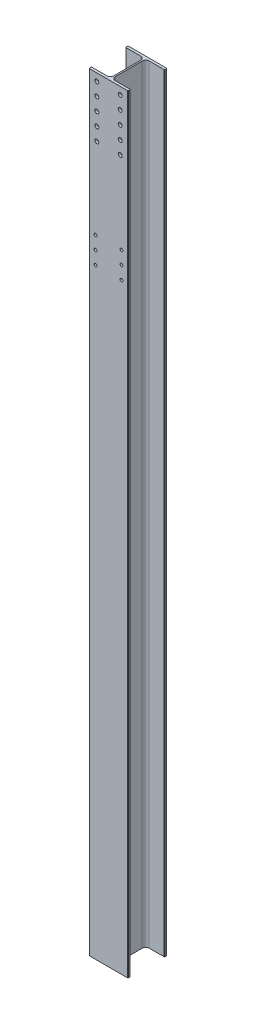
from build123d import *

# Parameters (mm, degrees)
HEB_300_CONFIGURED_HEB_300_OBROBIONA_1_DEPTH = 5914
SZKIC12_R                                    = 15.25
SZKIC12_R_2                                  = 11.25
WYTNIJ_WYCI_GNI_CIE1_DEPTH                   = 20


with BuildPart() as part:
    # Szkic11 → Heb 300 - configured HEB 300_OBROBIONA_1 (new body)
    with BuildSketch(Plane(origin=(0, 0, 0), x_dir=(-1, 0, 0), z_dir=(0, 1, 0))):
        with BuildLine():
            Line((-147, 150), (147, 150))
            ThreePointArc((147, 150), (149.121320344, 149.121320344), (150, 147))
            Line((150, 147), (150, 134))
            ThreePointArc((150, 134), (149.121320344, 131.878679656), (147, 131))
            Line((147, 131), (32.5, 131))
            ThreePointArc((32.5, 131), (13.408116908, 123.091883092), (5.5, 104))
            Line((5.5, 104), (5.5, -104))
            ThreePointArc((5.5, -104), (13.408116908, -123.091883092), (32.5, -131))
            Line((32.5, -131), (147, -131))
            ThreePointArc((147, -131), (149.121320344, -131.878679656), (150, -134))
            Line((150, -134), (150, -147))
            ThreePointArc((150, -147), (149.121320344, -149.121320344), (147, -150))
            Line((147, -150), (-147, -150))
            ThreePointArc((-147, -150), (-149.121320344, -149.121320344), (-150, -147))
            Line((-150, -147), (-150, -134))
            ThreePointArc((-150, -134), (-149.121320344, -131.878679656), (-147, -131))
            Line((-147, -131), (-32.5, -131))
            ThreePointArc((-32.5, -131), (-13.408116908, -123.091883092), (-5.5, -104))
            Line((-5.5, -104), (-5.5, 104))
            ThreePointArc((-5.5, 104), (-13.408116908, 123.091883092), (-32.5, 131))
            Line((-32.5, 131), (-147, 131))
            ThreePointArc((-147, 131), (-149.121320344, 131.878679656), (-150, 134))
            Line((-150, 134), (-150, 147))
            ThreePointArc((-150, 147), (-149.121320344, 149.121320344), (-147, 150))
        make_face()
    extrude(amount=HEB_300_CONFIGURED_HEB_300_OBROBIONA_1_DEPTH)

    # Szkic12 → Wytnij-wyci_gni_cie1 (cut)
    with BuildSketch(Plane.XY.offset(150)):
        with Locations((-90, 5857)):
            Circle(SZKIC12_R)
        with Locations((-100, 4828.5)):
            Circle(SZKIC12_R_2)
        with Locations((90, 5857)):
            Circle(SZKIC12_R)
        with Locations((90, 5757)):
            Circle(SZKIC12_R)
        with Locations((90, 5657)):
            Circle(SZKIC12_R)
        with Locations((90, 5557)):
            Circle(SZKIC12_R)
        with Locations((90, 5457)):
            Circle(SZKIC12_R)
        with Locations((-90, 5757)):
            Circle(SZKIC12_R)
        with Locations((-90, 5657)):
            Circle(SZKIC12_R)
        with Locations((-90, 5557)):
            Circle(SZKIC12_R)
        with Locations((-90, 5457)):
            Circle(SZKIC12_R)
        with Locations((100, 4828.5)):
            Circle(SZKIC12_R_2)
        with Locations((100, 4728)):
            Circle(SZKIC12_R_2)
        with Locations((100, 4627.5)):
            Circle(SZKIC12_R_2)
        with Locations((-100, 4728)):
            Circle(SZKIC12_R_2)
        with Locations((-100, 4627.5)):
            Circle(SZKIC12_R_2)
    extrude(amount=-WYTNIJ_WYCI_GNI_CIE1_DEPTH, mode=Mode.SUBTRACT)


solid = part.part
